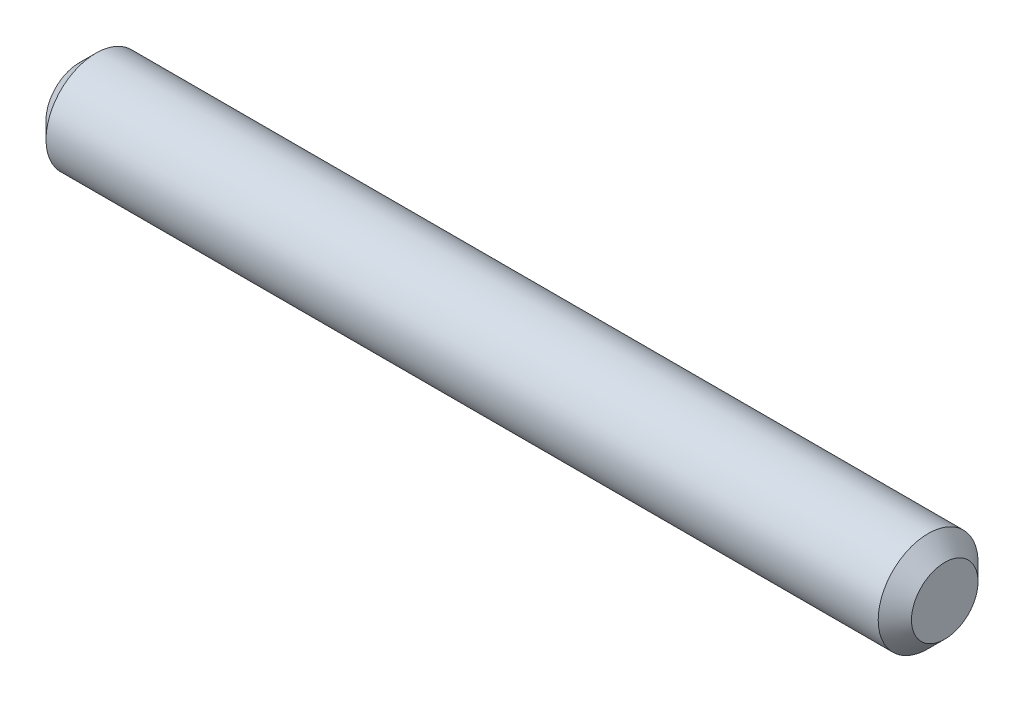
from build123d import *


with BuildPart() as part:
    # Sketch2 → Revolve1 (revolve)
    with BuildSketch(Plane.XY, mode=Mode.PRIVATE) as revolve1_sk:
        Polygon((-13, 0), (13, 0), (13, 1), (12.5, 1.5), (-12.5, 1.5), (-13, 1), align=None)
    revolve(revolve1_sk.sketch.rotate(Axis((-13, 0, 0), (1, 0, 0)), 90), axis=Axis((-13, 0, 0), (1, 0, 0)))


solid = part.part
